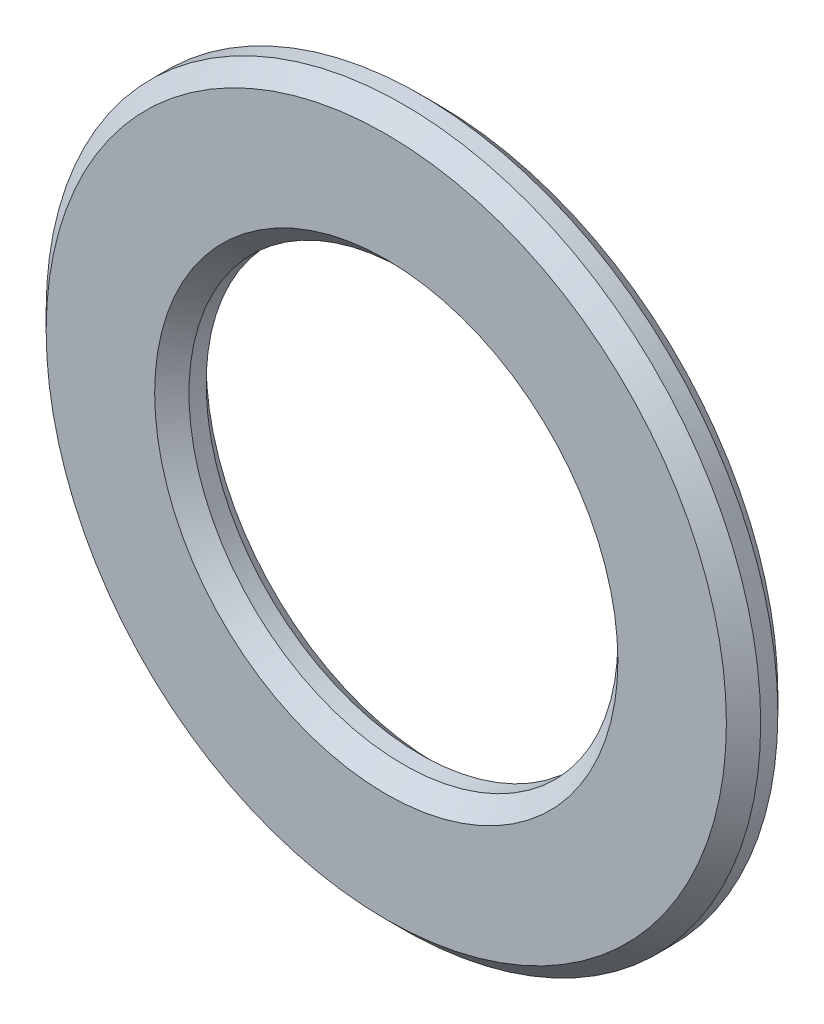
from build123d import *

# Parameters (mm, degrees)
SKETCH1_R      = 20.825
SKETCH1_R_2    = 12.5
EXTRUDE1_DEPTH = 3
CHAMFER1_SIZE  = 1


with BuildPart() as part:
    # Sketch1 → Extrude1 (new body)
    with BuildSketch(Plane.XY):
        Circle(SKETCH1_R)
        Circle(SKETCH1_R_2, mode=Mode.SUBTRACT)
    extrude(amount=EXTRUDE1_DEPTH)

    # Chamfer1
    chamfer1_edges = [part.edges().sort_by_distance(p)[0] for p in [
        (-20.825, 0, 0),
        (-20.825, 0, 3),
        (-12.5, 0, 0),
        (-12.5, 0, 3),
    ]]
    chamfer(chamfer1_edges, length=CHAMFER1_SIZE)


solid = part.part
